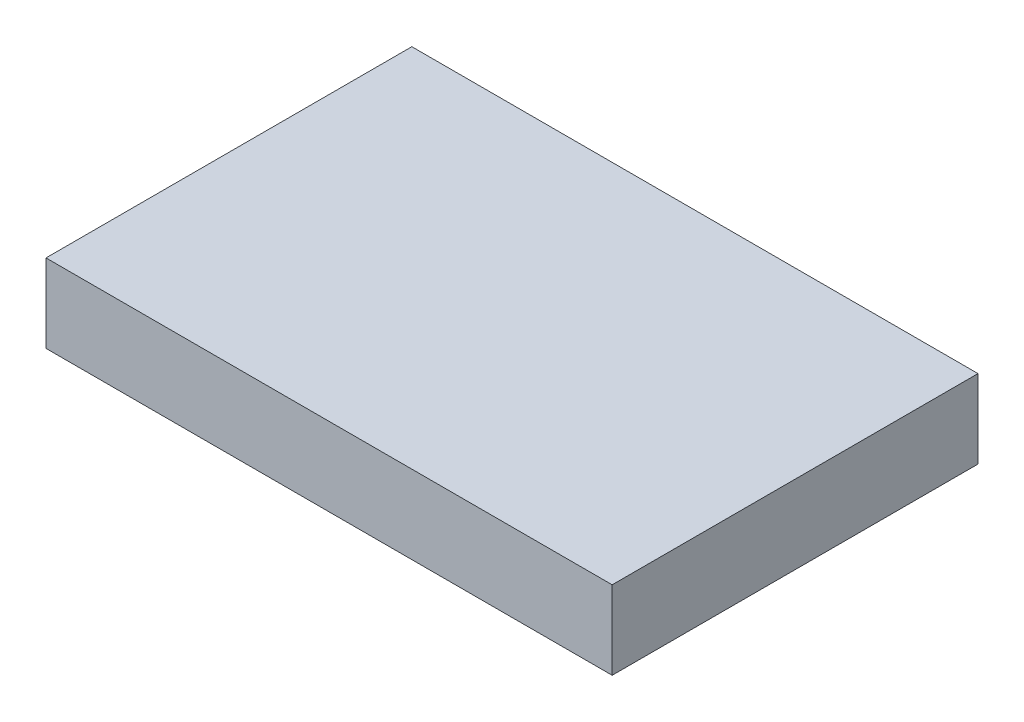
from build123d import *

# Parameters (mm, degrees)
SKETCH1_W           = 65.000000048
SKETCH1_H           = 42
BOSS_EXTRUDE2_DEPTH = 9


with BuildPart() as part:
    # Sketch1 → Boss-Extrude2 (new body)
    with BuildSketch(Plane(origin=(0, 0, 0), x_dir=(1, 0, 0), z_dir=(0, 1, 0))):
        with Locations((32.500000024, 21)):
            Rectangle(SKETCH1_W, SKETCH1_H)
    extrude(amount=BOSS_EXTRUDE2_DEPTH)


solid = part.part
